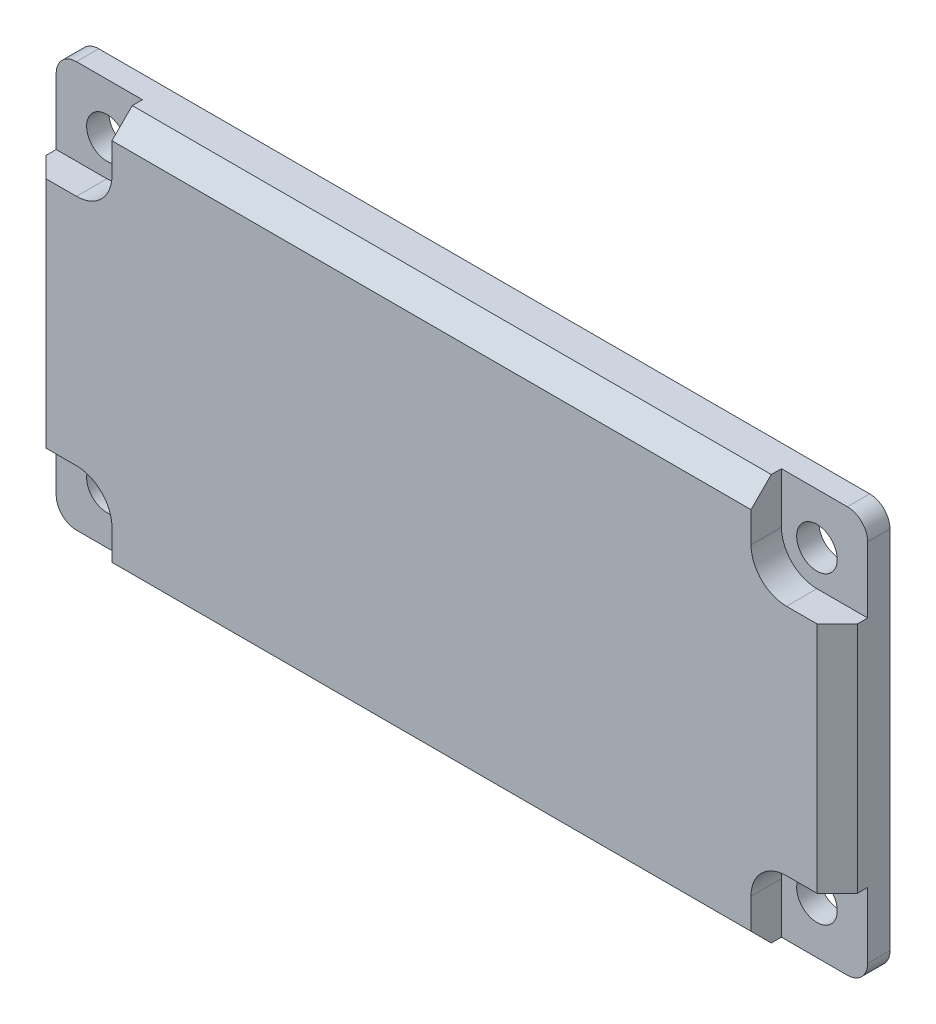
ISO-10303-21;
HEADER;
FILE_DESCRIPTION(('STEP AP214'),'2;1');
FILE_NAME('part.step','',(''),(''),'','','');
FILE_SCHEMA(('AUTOMOTIVE_DESIGN { 1 0 10303 214 1 1 1 1 }'));
ENDSEC;
DATA;
#1=APPLICATION_CONTEXT('core data for automotive mechanical design processes');
#2=APPLICATION_PROTOCOL_DEFINITION('international standard','automotive_design',2000,#1);
#3=PRODUCT_CONTEXT('',#1,'mechanical');
#4=PRODUCT('Part','Part','',(#3));
#5=PRODUCT_RELATED_PRODUCT_CATEGORY('part','',(#4));
#6=PRODUCT_DEFINITION_FORMATION('','',#4);
#7=PRODUCT_DEFINITION_CONTEXT('part definition',#1,'design');
#8=PRODUCT_DEFINITION('design','',#6,#7);
#9=PRODUCT_DEFINITION_SHAPE('','',#8);
#10=(LENGTH_UNIT() NAMED_UNIT(*) SI_UNIT(.MILLI.,.METRE.));
#11=(NAMED_UNIT(*) PLANE_ANGLE_UNIT() SI_UNIT($,.RADIAN.));
#12=(NAMED_UNIT(*) SI_UNIT($,.STERADIAN.) SOLID_ANGLE_UNIT());
#13=UNCERTAINTY_MEASURE_WITH_UNIT(LENGTH_MEASURE(1.E-05),#10,'distance_accuracy_value','');
#14=(GEOMETRIC_REPRESENTATION_CONTEXT(3) GLOBAL_UNCERTAINTY_ASSIGNED_CONTEXT((#13)) GLOBAL_UNIT_ASSIGNED_CONTEXT((#10,
#11,#12)) REPRESENTATION_CONTEXT('',''));
#15=CARTESIAN_POINT('',(0.,0.,0.));
#16=DIRECTION('',(0.,0.,1.));
#17=DIRECTION('',(1.,0.,0.));
#18=AXIS2_PLACEMENT_3D('',#15,#16,#17);
#19=CARTESIAN_POINT('',(-19.,9.,2.6));
#20=DIRECTION('',(0.,0.,-1.));
#21=DIRECTION('',(-1.,0.,0.));
#22=AXIS2_PLACEMENT_3D('',#19,#20,#21);
#23=CYLINDRICAL_SURFACE('',#22,0.999999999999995);
#24=CARTESIAN_POINT('',(-19.,9.,1.1));
#25=DIRECTION('',(0.,0.,1.));
#26=DIRECTION('',(1.,0.,0.));
#27=AXIS2_PLACEMENT_3D('',#24,#25,#26);
#28=CIRCLE('',#27,0.999999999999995);
#29=CARTESIAN_POINT('',(-19.,9.99999999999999,1.1));
#30=VERTEX_POINT('',#29);
#31=CARTESIAN_POINT('',(-20.,9.00000000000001,1.1));
#32=VERTEX_POINT('',#31);
#33=EDGE_CURVE('E322',#30,#32,#28,.T.);
#34=ORIENTED_EDGE('',*,*,#33,.F.);
#35=DIRECTION('',(0.,0.,-1.));
#36=VECTOR('',#35,1.);
#37=CARTESIAN_POINT('',(-19.,9.99999999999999,2.6));
#38=LINE('',#37,#36);
#39=CARTESIAN_POINT('',(-19.,9.99999999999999,0.));
#40=VERTEX_POINT('',#39);
#41=EDGE_CURVE('E391',#30,#40,#38,.T.);
#42=ORIENTED_EDGE('',*,*,#41,.T.);
#43=CARTESIAN_POINT('',(-19.,9.,0.));
#44=DIRECTION('',(0.,0.,1.));
#45=DIRECTION('',(1.,0.,0.));
#46=AXIS2_PLACEMENT_3D('',#43,#44,#45);
#47=CIRCLE('',#46,0.999999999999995);
#48=CARTESIAN_POINT('',(-20.,9.00000000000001,0.));
#49=VERTEX_POINT('',#48);
#50=EDGE_CURVE('E367',#40,#49,#47,.T.);
#51=ORIENTED_EDGE('',*,*,#50,.T.);
#52=DIRECTION('',(0.,0.,-1.));
#53=VECTOR('',#52,1.);
#54=CARTESIAN_POINT('',(-20.,9.00000000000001,2.6));
#55=LINE('',#54,#53);
#56=EDGE_CURVE('E405',#32,#49,#55,.T.);
#57=ORIENTED_EDGE('',*,*,#56,.F.);
#58=EDGE_LOOP('',(#34,#42,#51,#57));
#59=FACE_BOUND('',#58,.T.);
#60=ADVANCED_FACE('F33',(#59),#23,.T.);
#61=CARTESIAN_POINT('',(-20.,-9.00000000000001,2.6));
#62=DIRECTION('',(1.,0.,0.));
#63=DIRECTION('',(0.,1.,0.));
#64=AXIS2_PLACEMENT_3D('',#61,#62,#63);
#65=PLANE('',#64);
#66=DIRECTION('',(0.,-1.,0.));
#67=VECTOR('',#66,1.);
#68=CARTESIAN_POINT('',(-20.,-9.00000000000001,1.1));
#69=LINE('',#68,#67);
#70=CARTESIAN_POINT('',(-20.,5.75000000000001,1.1));
#71=VERTEX_POINT('',#70);
#72=EDGE_CURVE('E325',#32,#71,#69,.T.);
#73=ORIENTED_EDGE('',*,*,#72,.F.);
#74=ORIENTED_EDGE('',*,*,#56,.T.);
#75=DIRECTION('',(0.,-1.,0.));
#76=VECTOR('',#75,1.);
#77=CARTESIAN_POINT('',(-20.,-9.00000000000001,0.));
#78=LINE('',#77,#76);
#79=CARTESIAN_POINT('',(-20.,-9.00000000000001,0.));
#80=VERTEX_POINT('',#79);
#81=EDGE_CURVE('E370',#49,#80,#78,.T.);
#82=ORIENTED_EDGE('',*,*,#81,.T.);
#83=DIRECTION('',(0.,0.,-1.));
#84=VECTOR('',#83,1.);
#85=CARTESIAN_POINT('',(-20.,-9.00000000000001,2.6));
#86=LINE('',#85,#84);
#87=CARTESIAN_POINT('',(-20.,-9.00000000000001,1.1));
#88=VERTEX_POINT('',#87);
#89=EDGE_CURVE('E403',#88,#80,#86,.T.);
#90=ORIENTED_EDGE('',*,*,#89,.F.);
#91=CARTESIAN_POINT('',(-20.,-5.75000000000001,1.1));
#92=VERTEX_POINT('',#91);
#93=EDGE_CURVE('E327',#92,#88,#69,.T.);
#94=ORIENTED_EDGE('',*,*,#93,.F.);
#95=DIRECTION('',(0.,0.,-1.));
#96=VECTOR('',#95,1.);
#97=CARTESIAN_POINT('',(-20.,-5.75000000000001,2.6));
#98=LINE('',#97,#96);
#99=CARTESIAN_POINT('',(-20.,-5.75000000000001,1.6));
#100=VERTEX_POINT('',#99);
#101=EDGE_CURVE('E344',#100,#92,#98,.T.);
#102=ORIENTED_EDGE('',*,*,#101,.F.);
#103=DIRECTION('',(0.,1.,0.));
#104=VECTOR('',#103,1.);
#105=CARTESIAN_POINT('',(-20.,9.00000000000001,1.6));
#106=LINE('',#105,#104);
#107=CARTESIAN_POINT('',(-20.,5.75000000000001,1.6));
#108=VERTEX_POINT('',#107);
#109=EDGE_CURVE('E420',#100,#108,#106,.T.);
#110=ORIENTED_EDGE('',*,*,#109,.T.);
#111=DIRECTION('',(0.,0.,1.));
#112=VECTOR('',#111,1.);
#113=CARTESIAN_POINT('',(-20.,5.75000000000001,2.6));
#114=LINE('',#113,#112);
#115=EDGE_CURVE('E346',#71,#108,#114,.T.);
#116=ORIENTED_EDGE('',*,*,#115,.F.);
#117=EDGE_LOOP('',(#73,#74,#82,#90,#94,#102,#110,#116));
#118=FACE_BOUND('',#117,.T.);
#119=ADVANCED_FACE('F535',(#118),#65,.F.);
#120=CARTESIAN_POINT('',(-19.,-9.,2.6));
#121=DIRECTION('',(0.,0.,-1.));
#122=DIRECTION('',(-1.,0.,0.));
#123=AXIS2_PLACEMENT_3D('',#120,#121,#122);
#124=CYLINDRICAL_SURFACE('',#123,0.999999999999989);
#125=CARTESIAN_POINT('',(-19.,-9.,1.1));
#126=DIRECTION('',(0.,0.,1.));
#127=DIRECTION('',(1.,0.,0.));
#128=AXIS2_PLACEMENT_3D('',#125,#126,#127);
#129=CIRCLE('',#128,0.999999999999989);
#130=CARTESIAN_POINT('',(-19.,-9.99999999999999,1.1));
#131=VERTEX_POINT('',#130);
#132=EDGE_CURVE('E338',#88,#131,#129,.T.);
#133=ORIENTED_EDGE('',*,*,#132,.F.);
#134=ORIENTED_EDGE('',*,*,#89,.T.);
#135=CARTESIAN_POINT('',(-19.,-9.,0.));
#136=DIRECTION('',(0.,0.,1.));
#137=DIRECTION('',(1.,0.,0.));
#138=AXIS2_PLACEMENT_3D('',#135,#136,#137);
#139=CIRCLE('',#138,0.999999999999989);
#140=CARTESIAN_POINT('',(-19.,-9.99999999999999,0.));
#141=VERTEX_POINT('',#140);
#142=EDGE_CURVE('E373',#80,#141,#139,.T.);
#143=ORIENTED_EDGE('',*,*,#142,.T.);
#144=DIRECTION('',(0.,0.,-1.));
#145=VECTOR('',#144,1.);
#146=CARTESIAN_POINT('',(-19.,-9.99999999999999,2.6));
#147=LINE('',#146,#145);
#148=EDGE_CURVE('E401',#131,#141,#147,.T.);
#149=ORIENTED_EDGE('',*,*,#148,.F.);
#150=EDGE_LOOP('',(#133,#134,#143,#149));
#151=FACE_BOUND('',#150,.T.);
#152=ADVANCED_FACE('F479',(#151),#124,.T.);
#153=CARTESIAN_POINT('',(19.,-9.99999999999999,2.6));
#154=DIRECTION('',(0.,1.,0.));
#155=DIRECTION('',(-1.,0.,0.));
#156=AXIS2_PLACEMENT_3D('',#153,#154,#155);
#157=PLANE('',#156);
#158=DIRECTION('',(1.,0.,0.));
#159=VECTOR('',#158,1.);
#160=CARTESIAN_POINT('',(19.,-9.99999999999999,1.1));
#161=LINE('',#160,#159);
#162=CARTESIAN_POINT('',(15.75,-9.99999999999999,1.1));
#163=VERTEX_POINT('',#162);
#164=CARTESIAN_POINT('',(19.,-9.99999999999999,1.1));
#165=VERTEX_POINT('',#164);
#166=EDGE_CURVE('E335',#163,#165,#161,.T.);
#167=ORIENTED_EDGE('',*,*,#166,.F.);
#168=DIRECTION('',(0.,0.,-1.));
#169=VECTOR('',#168,1.);
#170=CARTESIAN_POINT('',(15.75,-9.99999999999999,2.6));
#171=LINE('',#170,#169);
#172=CARTESIAN_POINT('',(15.75,-9.99999999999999,1.6));
#173=VERTEX_POINT('',#172);
#174=EDGE_CURVE('E353',#173,#163,#171,.T.);
#175=ORIENTED_EDGE('',*,*,#174,.F.);
#176=DIRECTION('',(-1.,0.,0.));
#177=VECTOR('',#176,1.);
#178=CARTESIAN_POINT('',(-19.,-9.99999999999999,1.6));
#179=LINE('',#178,#177);
#180=CARTESIAN_POINT('',(-15.75,-9.99999999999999,1.6));
#181=VERTEX_POINT('',#180);
#182=EDGE_CURVE('E426',#173,#181,#179,.T.);
#183=ORIENTED_EDGE('',*,*,#182,.T.);
#184=DIRECTION('',(0.,0.,1.));
#185=VECTOR('',#184,1.);
#186=CARTESIAN_POINT('',(-15.75,-9.99999999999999,2.6));
#187=LINE('',#186,#185);
#188=CARTESIAN_POINT('',(-15.75,-9.99999999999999,1.1));
#189=VERTEX_POINT('',#188);
#190=EDGE_CURVE('E351',#189,#181,#187,.T.);
#191=ORIENTED_EDGE('',*,*,#190,.F.);
#192=EDGE_CURVE('E337',#131,#189,#161,.T.);
#193=ORIENTED_EDGE('',*,*,#192,.F.);
#194=ORIENTED_EDGE('',*,*,#148,.T.);
#195=DIRECTION('',(1.,0.,0.));
#196=VECTOR('',#195,1.);
#197=CARTESIAN_POINT('',(19.,-9.99999999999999,0.));
#198=LINE('',#197,#196);
#199=CARTESIAN_POINT('',(19.,-9.99999999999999,0.));
#200=VERTEX_POINT('',#199);
#201=EDGE_CURVE('E376',#141,#200,#198,.T.);
#202=ORIENTED_EDGE('',*,*,#201,.T.);
#203=DIRECTION('',(0.,0.,-1.));
#204=VECTOR('',#203,1.);
#205=CARTESIAN_POINT('',(19.,-9.99999999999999,2.6));
#206=LINE('',#205,#204);
#207=EDGE_CURVE('E399',#165,#200,#206,.T.);
#208=ORIENTED_EDGE('',*,*,#207,.F.);
#209=EDGE_LOOP('',(#167,#175,#183,#191,#193,#194,#202,#208));
#210=FACE_BOUND('',#209,.T.);
#211=ADVANCED_FACE('F456',(#210),#157,.F.);
#212=CARTESIAN_POINT('',(19.,-8.99999999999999,2.6));
#213=DIRECTION('',(0.,0.,-1.));
#214=DIRECTION('',(-1.,0.,0.));
#215=AXIS2_PLACEMENT_3D('',#212,#213,#214);
#216=CYLINDRICAL_SURFACE('',#215,0.999999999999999);
#217=CARTESIAN_POINT('',(19.,-8.99999999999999,1.1));
#218=DIRECTION('',(0.,0.,1.));
#219=DIRECTION('',(1.,0.,0.));
#220=AXIS2_PLACEMENT_3D('',#217,#218,#219);
#221=CIRCLE('',#220,0.999999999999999);
#222=CARTESIAN_POINT('',(20.,-9.,1.1));
#223=VERTEX_POINT('',#222);
#224=EDGE_CURVE('E333',#165,#223,#221,.T.);
#225=ORIENTED_EDGE('',*,*,#224,.F.);
#226=ORIENTED_EDGE('',*,*,#207,.T.);
#227=CARTESIAN_POINT('',(19.,-8.99999999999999,0.));
#228=DIRECTION('',(0.,0.,1.));
#229=DIRECTION('',(1.,0.,0.));
#230=AXIS2_PLACEMENT_3D('',#227,#228,#229);
#231=CIRCLE('',#230,0.999999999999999);
#232=CARTESIAN_POINT('',(20.,-9.,0.));
#233=VERTEX_POINT('',#232);
#234=EDGE_CURVE('E379',#200,#233,#231,.T.);
#235=ORIENTED_EDGE('',*,*,#234,.T.);
#236=DIRECTION('',(0.,0.,-1.));
#237=VECTOR('',#236,1.);
#238=CARTESIAN_POINT('',(20.,-9.,2.6));
#239=LINE('',#238,#237);
#240=EDGE_CURVE('E397',#223,#233,#239,.T.);
#241=ORIENTED_EDGE('',*,*,#240,.F.);
#242=EDGE_LOOP('',(#225,#226,#235,#241));
#243=FACE_BOUND('',#242,.T.);
#244=ADVANCED_FACE('F490',(#243),#216,.T.);
#245=CARTESIAN_POINT('',(20.,9.,2.6));
#246=DIRECTION('',(-1.,0.,0.));
#247=DIRECTION('',(0.,0.,1.));
#248=AXIS2_PLACEMENT_3D('',#245,#246,#247);
#249=PLANE('',#248);
#250=DIRECTION('',(0.,1.,0.));
#251=VECTOR('',#250,1.);
#252=CARTESIAN_POINT('',(20.,9.,1.1));
#253=LINE('',#252,#251);
#254=CARTESIAN_POINT('',(20.,5.75000000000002,1.1));
#255=VERTEX_POINT('',#254);
#256=CARTESIAN_POINT('',(20.,8.99999999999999,1.1));
#257=VERTEX_POINT('',#256);
#258=EDGE_CURVE('E330',#255,#257,#253,.T.);
#259=ORIENTED_EDGE('',*,*,#258,.F.);
#260=DIRECTION('',(0.,0.,-1.));
#261=VECTOR('',#260,1.);
#262=CARTESIAN_POINT('',(20.,5.75000000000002,2.6));
#263=LINE('',#262,#261);
#264=CARTESIAN_POINT('',(20.,5.75000000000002,1.6));
#265=VERTEX_POINT('',#264);
#266=EDGE_CURVE('E349',#265,#255,#263,.T.);
#267=ORIENTED_EDGE('',*,*,#266,.F.);
#268=DIRECTION('',(0.,-1.,0.));
#269=VECTOR('',#268,1.);
#270=CARTESIAN_POINT('',(20.,-9.,1.6));
#271=LINE('',#270,#269);
#272=CARTESIAN_POINT('',(20.,-5.75,1.6));
#273=VERTEX_POINT('',#272);
#274=EDGE_CURVE('E423',#265,#273,#271,.T.);
#275=ORIENTED_EDGE('',*,*,#274,.T.);
#276=DIRECTION('',(0.,0.,1.));
#277=VECTOR('',#276,1.);
#278=CARTESIAN_POINT('',(20.,-5.75,2.6));
#279=LINE('',#278,#277);
#280=CARTESIAN_POINT('',(20.,-5.75000000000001,1.1));
#281=VERTEX_POINT('',#280);
#282=EDGE_CURVE('E47',#281,#273,#279,.T.);
#283=ORIENTED_EDGE('',*,*,#282,.F.);
#284=EDGE_CURVE('E332',#223,#281,#253,.T.);
#285=ORIENTED_EDGE('',*,*,#284,.F.);
#286=ORIENTED_EDGE('',*,*,#240,.T.);
#287=DIRECTION('',(0.,1.,0.));
#288=VECTOR('',#287,1.);
#289=CARTESIAN_POINT('',(20.,9.,0.));
#290=LINE('',#289,#288);
#291=CARTESIAN_POINT('',(20.,9.,0.));
#292=VERTEX_POINT('',#291);
#293=EDGE_CURVE('E382',#233,#292,#290,.T.);
#294=ORIENTED_EDGE('',*,*,#293,.T.);
#295=DIRECTION('',(0.,0.,-1.));
#296=VECTOR('',#295,1.);
#297=CARTESIAN_POINT('',(20.,9.,2.6));
#298=LINE('',#297,#296);
#299=EDGE_CURVE('E395',#257,#292,#298,.T.);
#300=ORIENTED_EDGE('',*,*,#299,.F.);
#301=EDGE_LOOP('',(#259,#267,#275,#283,#285,#286,#294,#300));
#302=FACE_BOUND('',#301,.T.);
#303=ADVANCED_FACE('F495',(#302),#249,.F.);
#304=CARTESIAN_POINT('',(19.,8.99999999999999,2.6));
#305=DIRECTION('',(0.,0.,-1.));
#306=DIRECTION('',(-1.,0.,0.));
#307=AXIS2_PLACEMENT_3D('',#304,#305,#306);
#308=CYLINDRICAL_SURFACE('',#307,0.999999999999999);
#309=CARTESIAN_POINT('',(19.,8.99999999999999,1.1));
#310=DIRECTION('',(0.,0.,1.));
#311=DIRECTION('',(1.,0.,0.));
#312=AXIS2_PLACEMENT_3D('',#309,#310,#311);
#313=CIRCLE('',#312,0.999999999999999);
#314=CARTESIAN_POINT('',(19.,9.99999999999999,1.1));
#315=VERTEX_POINT('',#314);
#316=EDGE_CURVE('E328',#257,#315,#313,.T.);
#317=ORIENTED_EDGE('',*,*,#316,.F.);
#318=ORIENTED_EDGE('',*,*,#299,.T.);
#319=CARTESIAN_POINT('',(19.,8.99999999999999,0.));
#320=DIRECTION('',(0.,0.,1.));
#321=DIRECTION('',(1.,0.,0.));
#322=AXIS2_PLACEMENT_3D('',#319,#320,#321);
#323=CIRCLE('',#322,0.999999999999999);
#324=CARTESIAN_POINT('',(19.,9.99999999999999,0.));
#325=VERTEX_POINT('',#324);
#326=EDGE_CURVE('E385',#292,#325,#323,.T.);
#327=ORIENTED_EDGE('',*,*,#326,.T.);
#328=DIRECTION('',(0.,0.,-1.));
#329=VECTOR('',#328,1.);
#330=CARTESIAN_POINT('',(19.,9.99999999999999,2.6));
#331=LINE('',#330,#329);
#332=EDGE_CURVE('E393',#315,#325,#331,.T.);
#333=ORIENTED_EDGE('',*,*,#332,.F.);
#334=EDGE_LOOP('',(#317,#318,#327,#333));
#335=FACE_BOUND('',#334,.T.);
#336=ADVANCED_FACE('F543',(#335),#308,.T.);
#337=CARTESIAN_POINT('',(-19.,9.99999999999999,2.6));
#338=DIRECTION('',(0.,-1.,0.));
#339=DIRECTION('',(1.,0.,0.));
#340=AXIS2_PLACEMENT_3D('',#337,#338,#339);
#341=PLANE('',#340);
#342=DIRECTION('',(-1.,0.,0.));
#343=VECTOR('',#342,1.);
#344=CARTESIAN_POINT('',(-19.,9.99999999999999,1.1));
#345=LINE('',#344,#343);
#346=CARTESIAN_POINT('',(-15.75,9.99999999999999,1.1));
#347=VERTEX_POINT('',#346);
#348=EDGE_CURVE('E320',#347,#30,#345,.T.);
#349=ORIENTED_EDGE('',*,*,#348,.F.);
#350=DIRECTION('',(0.,0.,-1.));
#351=VECTOR('',#350,1.);
#352=CARTESIAN_POINT('',(-15.75,9.99999999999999,2.6));
#353=LINE('',#352,#351);
#354=CARTESIAN_POINT('',(-15.75,9.99999999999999,1.6));
#355=VERTEX_POINT('',#354);
#356=EDGE_CURVE('E342',#355,#347,#353,.T.);
#357=ORIENTED_EDGE('',*,*,#356,.F.);
#358=DIRECTION('',(1.,0.,0.));
#359=VECTOR('',#358,1.);
#360=CARTESIAN_POINT('',(19.,9.99999999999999,1.6));
#361=LINE('',#360,#359);
#362=CARTESIAN_POINT('',(15.75,9.99999999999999,1.6));
#363=VERTEX_POINT('',#362);
#364=EDGE_CURVE('E417',#355,#363,#361,.T.);
#365=ORIENTED_EDGE('',*,*,#364,.T.);
#366=DIRECTION('',(0.,0.,1.));
#367=VECTOR('',#366,1.);
#368=CARTESIAN_POINT('',(15.75,9.99999999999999,2.6));
#369=LINE('',#368,#367);
#370=CARTESIAN_POINT('',(15.75,9.99999999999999,1.1));
#371=VERTEX_POINT('',#370);
#372=EDGE_CURVE('E340',#371,#363,#369,.T.);
#373=ORIENTED_EDGE('',*,*,#372,.F.);
#374=EDGE_CURVE('E323',#315,#371,#345,.T.);
#375=ORIENTED_EDGE('',*,*,#374,.F.);
#376=ORIENTED_EDGE('',*,*,#332,.T.);
#377=DIRECTION('',(-1.,0.,0.));
#378=VECTOR('',#377,1.);
#379=CARTESIAN_POINT('',(-19.,9.99999999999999,0.));
#380=LINE('',#379,#378);
#381=EDGE_CURVE('E388',#325,#40,#380,.T.);
#382=ORIENTED_EDGE('',*,*,#381,.T.);
#383=ORIENTED_EDGE('',*,*,#41,.F.);
#384=EDGE_LOOP('',(#349,#357,#365,#373,#375,#376,#382,#383));
#385=FACE_BOUND('',#384,.T.);
#386=ADVANCED_FACE('F524',(#385),#341,.F.);
#387=CARTESIAN_POINT('',(-19.,9.,2.6));
#388=DIRECTION('',(0.,0.,1.));
#389=DIRECTION('',(1.,0.,0.));
#390=AXIS2_PLACEMENT_3D('',#387,#388,#389);
#391=PLANE('',#390);
#392=CARTESIAN_POINT('',(-17.5,7.49999999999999,2.6));
#393=DIRECTION('',(0.,0.,-1.));
#394=DIRECTION('',(1.,0.,0.));
#395=AXIS2_PLACEMENT_3D('',#392,#393,#394);
#396=CIRCLE('',#395,1.74999999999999);
#397=CARTESIAN_POINT('',(-15.75,7.50000000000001,2.6));
#398=VERTEX_POINT('',#397);
#399=CARTESIAN_POINT('',(-17.5,5.75000000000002,2.6));
#400=VERTEX_POINT('',#399);
#401=EDGE_CURVE('E265',#398,#400,#396,.T.);
#402=ORIENTED_EDGE('',*,*,#401,.T.);
#403=DIRECTION('',(-1.,0.,0.));
#404=VECTOR('',#403,1.);
#405=CARTESIAN_POINT('',(-22.2797960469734,5.75,2.6));
#406=LINE('',#405,#404);
#407=CARTESIAN_POINT('',(-19.,5.75000000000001,2.6));
#408=VERTEX_POINT('',#407);
#409=EDGE_CURVE('E267',#400,#408,#406,.T.);
#410=ORIENTED_EDGE('',*,*,#409,.T.);
#411=DIRECTION('',(0.,-1.,0.));
#412=VECTOR('',#411,1.);
#413=CARTESIAN_POINT('',(-19.,-9.00000000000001,2.6));
#414=LINE('',#413,#412);
#415=CARTESIAN_POINT('',(-19.,-5.75000000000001,2.6));
#416=VERTEX_POINT('',#415);
#417=EDGE_CURVE('E240',#408,#416,#414,.T.);
#418=ORIENTED_EDGE('',*,*,#417,.T.);
#419=DIRECTION('',(1.,0.,0.));
#420=VECTOR('',#419,1.);
#421=CARTESIAN_POINT('',(-22.2797960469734,-5.75000000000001,2.6));
#422=LINE('',#421,#420);
#423=CARTESIAN_POINT('',(-17.5,-5.75000000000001,2.6));
#424=VERTEX_POINT('',#423);
#425=EDGE_CURVE('E55',#416,#424,#422,.T.);
#426=ORIENTED_EDGE('',*,*,#425,.T.);
#427=CARTESIAN_POINT('',(-17.5,-7.5,2.6));
#428=DIRECTION('',(0.,0.,-1.));
#429=DIRECTION('',(-1.,0.,0.));
#430=AXIS2_PLACEMENT_3D('',#427,#428,#429);
#431=CIRCLE('',#430,1.74999999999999);
#432=CARTESIAN_POINT('',(-15.75,-7.5,2.6));
#433=VERTEX_POINT('',#432);
#434=EDGE_CURVE('E228',#424,#433,#431,.T.);
#435=ORIENTED_EDGE('',*,*,#434,.T.);
#436=DIRECTION('',(0.,-1.,0.));
#437=VECTOR('',#436,1.);
#438=CARTESIAN_POINT('',(-15.75,-7.5,2.6));
#439=LINE('',#438,#437);
#440=CARTESIAN_POINT('',(-15.75,-8.99999999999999,2.6));
#441=VERTEX_POINT('',#440);
#442=EDGE_CURVE('E233',#433,#441,#439,.T.);
#443=ORIENTED_EDGE('',*,*,#442,.T.);
#444=DIRECTION('',(1.,0.,0.));
#445=VECTOR('',#444,1.);
#446=CARTESIAN_POINT('',(19.,-8.99999999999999,2.6));
#447=LINE('',#446,#445);
#448=CARTESIAN_POINT('',(15.75,-8.99999999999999,2.6));
#449=VERTEX_POINT('',#448);
#450=EDGE_CURVE('E407',#441,#449,#447,.T.);
#451=ORIENTED_EDGE('',*,*,#450,.T.);
#452=DIRECTION('',(0.,1.,0.));
#453=VECTOR('',#452,1.);
#454=CARTESIAN_POINT('',(15.75,-11.9304852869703,2.6));
#455=LINE('',#454,#453);
#456=CARTESIAN_POINT('',(15.75,-7.5,2.6));
#457=VERTEX_POINT('',#456);
#458=EDGE_CURVE('E244',#449,#457,#455,.T.);
#459=ORIENTED_EDGE('',*,*,#458,.T.);
#460=CARTESIAN_POINT('',(17.5,-7.49999999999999,2.6));
#461=DIRECTION('',(0.,0.,-1.));
#462=DIRECTION('',(-1.,0.,0.));
#463=AXIS2_PLACEMENT_3D('',#460,#461,#462);
#464=CIRCLE('',#463,1.74999999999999);
#465=CARTESIAN_POINT('',(17.5,-5.75000000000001,2.6));
#466=VERTEX_POINT('',#465);
#467=EDGE_CURVE('E247',#457,#466,#464,.T.);
#468=ORIENTED_EDGE('',*,*,#467,.T.);
#469=DIRECTION('',(1.,0.,0.));
#470=VECTOR('',#469,1.);
#471=CARTESIAN_POINT('',(17.5,-5.75000000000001,2.6));
#472=LINE('',#471,#470);
#473=CARTESIAN_POINT('',(19.,-5.75000000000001,2.6));
#474=VERTEX_POINT('',#473);
#475=EDGE_CURVE('E250',#466,#474,#472,.T.);
#476=ORIENTED_EDGE('',*,*,#475,.T.);
#477=DIRECTION('',(0.,1.,0.));
#478=VECTOR('',#477,1.);
#479=CARTESIAN_POINT('',(19.,9.,2.6));
#480=LINE('',#479,#478);
#481=CARTESIAN_POINT('',(19.,5.75000000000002,2.6));
#482=VERTEX_POINT('',#481);
#483=EDGE_CURVE('E410',#474,#482,#480,.T.);
#484=ORIENTED_EDGE('',*,*,#483,.T.);
#485=DIRECTION('',(-1.,0.,0.));
#486=VECTOR('',#485,1.);
#487=CARTESIAN_POINT('',(17.5,5.75000000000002,2.6));
#488=LINE('',#487,#486);
#489=CARTESIAN_POINT('',(17.5,5.75000000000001,2.6));
#490=VERTEX_POINT('',#489);
#491=EDGE_CURVE('E253',#482,#490,#488,.T.);
#492=ORIENTED_EDGE('',*,*,#491,.T.);
#493=CARTESIAN_POINT('',(17.5,7.5,2.6));
#494=DIRECTION('',(0.,0.,-1.));
#495=DIRECTION('',(1.,0.,0.));
#496=AXIS2_PLACEMENT_3D('',#493,#494,#495);
#497=CIRCLE('',#496,1.74999999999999);
#498=CARTESIAN_POINT('',(15.75,7.50000000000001,2.6));
#499=VERTEX_POINT('',#498);
#500=EDGE_CURVE('E256',#490,#499,#497,.T.);
#501=ORIENTED_EDGE('',*,*,#500,.T.);
#502=DIRECTION('',(0.,1.,0.));
#503=VECTOR('',#502,1.);
#504=CARTESIAN_POINT('',(15.75,11.9304852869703,2.6));
#505=LINE('',#504,#503);
#506=CARTESIAN_POINT('',(15.75,8.99999999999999,2.6));
#507=VERTEX_POINT('',#506);
#508=EDGE_CURVE('E259',#499,#507,#505,.T.);
#509=ORIENTED_EDGE('',*,*,#508,.T.);
#510=DIRECTION('',(-1.,0.,0.));
#511=VECTOR('',#510,1.);
#512=CARTESIAN_POINT('',(-19.,8.99999999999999,2.6));
#513=LINE('',#512,#511);
#514=CARTESIAN_POINT('',(-15.75,8.99999999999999,2.6));
#515=VERTEX_POINT('',#514);
#516=EDGE_CURVE('E414',#507,#515,#513,.T.);
#517=ORIENTED_EDGE('',*,*,#516,.T.);
#518=DIRECTION('',(0.,-1.,0.));
#519=VECTOR('',#518,1.);
#520=CARTESIAN_POINT('',(-15.75,7.50000000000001,2.6));
#521=LINE('',#520,#519);
#522=EDGE_CURVE('E262',#515,#398,#521,.T.);
#523=ORIENTED_EDGE('',*,*,#522,.T.);
#524=EDGE_LOOP('',(#402,#410,#418,#426,#435,#443,#451,#459,#468,#476,#484,#492,#501,#509,#517,#523));
#525=FACE_BOUND('',#524,.T.);
#526=ADVANCED_FACE('F237',(#525),#391,.T.);
#527=CARTESIAN_POINT('',(-19.,-8.99999999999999,2.6));
#528=DIRECTION('',(0.,-0.707106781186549,0.707106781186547));
#529=DIRECTION('',(0.,-0.707106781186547,-0.707106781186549));
#530=AXIS2_PLACEMENT_3D('',#527,#528,#529);
#531=PLANE('',#530);
#532=ORIENTED_EDGE('',*,*,#182,.F.);
#533=DIRECTION('',(0.,0.707106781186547,0.707106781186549));
#534=VECTOR('',#533,1.);
#535=CARTESIAN_POINT('',(15.75,-8.99999999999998,2.60000000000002));
#536=LINE('',#535,#534);
#537=EDGE_CURVE('E12',#173,#449,#536,.T.);
#538=ORIENTED_EDGE('',*,*,#537,.T.);
#539=ORIENTED_EDGE('',*,*,#450,.F.);
#540=DIRECTION('',(0.,-0.707106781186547,-0.707106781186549));
#541=VECTOR('',#540,1.);
#542=CARTESIAN_POINT('',(-15.75,-8.99999999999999,2.6));
#543=LINE('',#542,#541);
#544=EDGE_CURVE('E40',#441,#181,#543,.T.);
#545=ORIENTED_EDGE('',*,*,#544,.T.);
#546=EDGE_LOOP('',(#532,#538,#539,#545));
#547=FACE_BOUND('',#546,.T.);
#548=ADVANCED_FACE('F450',(#547),#531,.T.);
#549=CARTESIAN_POINT('',(19.,9.,2.6));
#550=DIRECTION('',(0.70710678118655,0.,0.707106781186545));
#551=DIRECTION('',(0.707106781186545,0.,-0.70710678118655));
#552=AXIS2_PLACEMENT_3D('',#549,#550,#551);
#553=PLANE('',#552);
#554=ORIENTED_EDGE('',*,*,#274,.F.);
#555=DIRECTION('',(-0.707106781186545,0.,0.70710678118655));
#556=VECTOR('',#555,1.);
#557=CARTESIAN_POINT('',(19.,5.75000000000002,2.6));
#558=LINE('',#557,#556);
#559=EDGE_CURVE('E444',#265,#482,#558,.T.);
#560=ORIENTED_EDGE('',*,*,#559,.T.);
#561=ORIENTED_EDGE('',*,*,#483,.F.);
#562=DIRECTION('',(0.707106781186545,0.,-0.70710678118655));
#563=VECTOR('',#562,1.);
#564=CARTESIAN_POINT('',(19.,-5.75000000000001,2.59999999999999));
#565=LINE('',#564,#563);
#566=EDGE_CURVE('E442',#474,#273,#565,.T.);
#567=ORIENTED_EDGE('',*,*,#566,.T.);
#568=EDGE_LOOP('',(#554,#560,#561,#567));
#569=FACE_BOUND('',#568,.T.);
#570=ADVANCED_FACE('F499',(#569),#553,.T.);
#571=CARTESIAN_POINT('',(-19.,9.,2.6));
#572=DIRECTION('',(-0.707106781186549,0.,0.707106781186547));
#573=DIRECTION('',(0.707106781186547,0.,0.707106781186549));
#574=AXIS2_PLACEMENT_3D('',#571,#572,#573);
#575=PLANE('',#574);
#576=ORIENTED_EDGE('',*,*,#417,.F.);
#577=DIRECTION('',(-0.707106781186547,0.,-0.707106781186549));
#578=VECTOR('',#577,1.);
#579=CARTESIAN_POINT('',(-19.,5.75000000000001,2.60000000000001));
#580=LINE('',#579,#578);
#581=EDGE_CURVE('E439',#408,#108,#580,.T.);
#582=ORIENTED_EDGE('',*,*,#581,.T.);
#583=ORIENTED_EDGE('',*,*,#109,.F.);
#584=DIRECTION('',(0.707106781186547,0.,0.707106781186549));
#585=VECTOR('',#584,1.);
#586=CARTESIAN_POINT('',(-19.,-5.75000000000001,2.6));
#587=LINE('',#586,#585);
#588=EDGE_CURVE('E437',#100,#416,#587,.T.);
#589=ORIENTED_EDGE('',*,*,#588,.T.);
#590=EDGE_LOOP('',(#576,#582,#583,#589));
#591=FACE_BOUND('',#590,.T.);
#592=ADVANCED_FACE('F592',(#591),#575,.T.);
#593=CARTESIAN_POINT('',(-19.,8.99999999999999,2.6));
#594=DIRECTION('',(0.,0.707106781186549,0.707106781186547));
#595=DIRECTION('',(0.,-0.707106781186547,0.707106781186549));
#596=AXIS2_PLACEMENT_3D('',#593,#594,#595);
#597=PLANE('',#596);
#598=ORIENTED_EDGE('',*,*,#364,.F.);
#599=DIRECTION('',(0.,-0.707106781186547,0.707106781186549));
#600=VECTOR('',#599,1.);
#601=CARTESIAN_POINT('',(-15.75,9.,2.59999999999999));
#602=LINE('',#601,#600);
#603=EDGE_CURVE('E434',#355,#515,#602,.T.);
#604=ORIENTED_EDGE('',*,*,#603,.T.);
#605=ORIENTED_EDGE('',*,*,#516,.F.);
#606=DIRECTION('',(0.,0.707106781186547,-0.707106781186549));
#607=VECTOR('',#606,1.);
#608=CARTESIAN_POINT('',(15.75,8.99999999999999,2.6));
#609=LINE('',#608,#607);
#610=EDGE_CURVE('E429',#507,#363,#609,.T.);
#611=ORIENTED_EDGE('',*,*,#610,.T.);
#612=EDGE_LOOP('',(#598,#604,#605,#611));
#613=FACE_BOUND('',#612,.T.);
#614=ADVANCED_FACE('F517',(#613),#597,.T.);
#615=CARTESIAN_POINT('',(-17.5,7.49999999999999,0.));
#616=DIRECTION('',(0.,0.,1.));
#617=DIRECTION('',(1.,0.,0.));
#618=AXIS2_PLACEMENT_3D('',#615,#616,#617);
#619=CYLINDRICAL_SURFACE('',#618,1.);
#620=CARTESIAN_POINT('',(-17.5,7.49999999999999,0.));
#621=DIRECTION('',(0.,0.,1.));
#622=DIRECTION('',(1.,0.,0.));
#623=AXIS2_PLACEMENT_3D('',#620,#621,#622);
#624=CIRCLE('',#623,1.);
#625=CARTESIAN_POINT('',(-16.5,7.49999999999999,0.));
#626=VERTEX_POINT('',#625);
#627=EDGE_CURVE('E364',#626,#626,#624,.T.);
#628=ORIENTED_EDGE('',*,*,#627,.F.);
#629=EDGE_LOOP('',(#628));
#630=FACE_BOUND('',#629,.T.);
#631=CARTESIAN_POINT('',(-17.5,7.49999999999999,1.1));
#632=DIRECTION('',(0.,0.,1.));
#633=DIRECTION('',(1.,0.,0.));
#634=AXIS2_PLACEMENT_3D('',#631,#632,#633);
#635=CIRCLE('',#634,1.);
#636=CARTESIAN_POINT('',(-16.5,7.49999999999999,1.1));
#637=VERTEX_POINT('',#636);
#638=EDGE_CURVE('E317',#637,#637,#635,.F.);
#639=ORIENTED_EDGE('',*,*,#638,.F.);
#640=EDGE_LOOP('',(#639));
#641=FACE_BOUND('',#640,.T.);
#642=ADVANCED_FACE('F598',(#630,#641),#619,.F.);
#643=CARTESIAN_POINT('',(17.5,7.49999999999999,0.));
#644=DIRECTION('',(0.,0.,1.));
#645=DIRECTION('',(1.,0.,0.));
#646=AXIS2_PLACEMENT_3D('',#643,#644,#645);
#647=CYLINDRICAL_SURFACE('',#646,1.);
#648=CARTESIAN_POINT('',(17.5,7.49999999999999,0.));
#649=DIRECTION('',(0.,0.,1.));
#650=DIRECTION('',(1.,0.,0.));
#651=AXIS2_PLACEMENT_3D('',#648,#649,#650);
#652=CIRCLE('',#651,1.);
#653=CARTESIAN_POINT('',(18.5,7.49999999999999,0.));
#654=VERTEX_POINT('',#653);
#655=EDGE_CURVE('E361',#654,#654,#652,.T.);
#656=ORIENTED_EDGE('',*,*,#655,.F.);
#657=EDGE_LOOP('',(#656));
#658=FACE_BOUND('',#657,.T.);
#659=CARTESIAN_POINT('',(17.5,7.49999999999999,1.1));
#660=DIRECTION('',(0.,0.,1.));
#661=DIRECTION('',(1.,0.,0.));
#662=AXIS2_PLACEMENT_3D('',#659,#660,#661);
#663=CIRCLE('',#662,1.);
#664=CARTESIAN_POINT('',(18.5,7.49999999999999,1.1));
#665=VERTEX_POINT('',#664);
#666=EDGE_CURVE('E314',#665,#665,#663,.F.);
#667=ORIENTED_EDGE('',*,*,#666,.F.);
#668=EDGE_LOOP('',(#667));
#669=FACE_BOUND('',#668,.T.);
#670=ADVANCED_FACE('F601',(#658,#669),#647,.F.);
#671=CARTESIAN_POINT('',(17.5,-7.49999999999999,0.));
#672=DIRECTION('',(0.,0.,1.));
#673=DIRECTION('',(1.,0.,0.));
#674=AXIS2_PLACEMENT_3D('',#671,#672,#673);
#675=CYLINDRICAL_SURFACE('',#674,1.);
#676=CARTESIAN_POINT('',(17.5,-7.49999999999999,0.));
#677=DIRECTION('',(0.,0.,1.));
#678=DIRECTION('',(1.,0.,0.));
#679=AXIS2_PLACEMENT_3D('',#676,#677,#678);
#680=CIRCLE('',#679,1.);
#681=CARTESIAN_POINT('',(18.5,-7.49999999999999,0.));
#682=VERTEX_POINT('',#681);
#683=EDGE_CURVE('E358',#682,#682,#680,.T.);
#684=ORIENTED_EDGE('',*,*,#683,.F.);
#685=EDGE_LOOP('',(#684));
#686=FACE_BOUND('',#685,.T.);
#687=CARTESIAN_POINT('',(17.5,-7.49999999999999,1.1));
#688=DIRECTION('',(0.,0.,1.));
#689=DIRECTION('',(1.,0.,0.));
#690=AXIS2_PLACEMENT_3D('',#687,#688,#689);
#691=CIRCLE('',#690,1.);
#692=CARTESIAN_POINT('',(18.5,-7.49999999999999,1.1));
#693=VERTEX_POINT('',#692);
#694=EDGE_CURVE('E311',#693,#693,#691,.F.);
#695=ORIENTED_EDGE('',*,*,#694,.F.);
#696=EDGE_LOOP('',(#695));
#697=FACE_BOUND('',#696,.T.);
#698=ADVANCED_FACE('F605',(#686,#697),#675,.F.);
#699=CARTESIAN_POINT('',(-17.5,-7.49999999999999,0.));
#700=DIRECTION('',(0.,0.,1.));
#701=DIRECTION('',(1.,0.,0.));
#702=AXIS2_PLACEMENT_3D('',#699,#700,#701);
#703=CYLINDRICAL_SURFACE('',#702,1.);
#704=CARTESIAN_POINT('',(-17.5,-7.49999999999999,0.));
#705=DIRECTION('',(0.,0.,1.));
#706=DIRECTION('',(1.,0.,0.));
#707=AXIS2_PLACEMENT_3D('',#704,#705,#706);
#708=CIRCLE('',#707,1.);
#709=CARTESIAN_POINT('',(-16.5,-7.49999999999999,0.));
#710=VERTEX_POINT('',#709);
#711=EDGE_CURVE('E355',#710,#710,#708,.T.);
#712=ORIENTED_EDGE('',*,*,#711,.F.);
#713=EDGE_LOOP('',(#712));
#714=FACE_BOUND('',#713,.T.);
#715=CARTESIAN_POINT('',(-17.5,-7.49999999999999,1.1));
#716=DIRECTION('',(0.,0.,1.));
#717=DIRECTION('',(1.,0.,0.));
#718=AXIS2_PLACEMENT_3D('',#715,#716,#717);
#719=CIRCLE('',#718,1.);
#720=CARTESIAN_POINT('',(-16.5,-7.49999999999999,1.1));
#721=VERTEX_POINT('',#720);
#722=EDGE_CURVE('E299',#721,#721,#719,.F.);
#723=ORIENTED_EDGE('',*,*,#722,.F.);
#724=EDGE_LOOP('',(#723));
#725=FACE_BOUND('',#724,.T.);
#726=ADVANCED_FACE('F586',(#714,#725),#703,.F.);
#727=CARTESIAN_POINT('',(-19.,9.,0.));
#728=DIRECTION('',(0.,0.,1.));
#729=DIRECTION('',(1.,0.,0.));
#730=AXIS2_PLACEMENT_3D('',#727,#728,#729);
#731=PLANE('',#730);
#732=ORIENTED_EDGE('',*,*,#711,.T.);
#733=EDGE_LOOP('',(#732));
#734=FACE_BOUND('',#733,.T.);
#735=ORIENTED_EDGE('',*,*,#683,.T.);
#736=EDGE_LOOP('',(#735));
#737=FACE_BOUND('',#736,.T.);
#738=ORIENTED_EDGE('',*,*,#655,.T.);
#739=EDGE_LOOP('',(#738));
#740=FACE_BOUND('',#739,.T.);
#741=ORIENTED_EDGE('',*,*,#627,.T.);
#742=EDGE_LOOP('',(#741));
#743=FACE_BOUND('',#742,.T.);
#744=ORIENTED_EDGE('',*,*,#50,.F.);
#745=ORIENTED_EDGE('',*,*,#381,.F.);
#746=ORIENTED_EDGE('',*,*,#326,.F.);
#747=ORIENTED_EDGE('',*,*,#293,.F.);
#748=ORIENTED_EDGE('',*,*,#234,.F.);
#749=ORIENTED_EDGE('',*,*,#201,.F.);
#750=ORIENTED_EDGE('',*,*,#142,.F.);
#751=ORIENTED_EDGE('',*,*,#81,.F.);
#752=EDGE_LOOP('',(#744,#745,#746,#747,#748,#749,#750,#751));
#753=FACE_BOUND('',#752,.T.);
#754=ADVANCED_FACE('F487',(#734,#737,#740,#743,#753),#731,.F.);
#755=CARTESIAN_POINT('',(0.609603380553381,0.,1.1));
#756=DIRECTION('',(0.,0.,1.));
#757=DIRECTION('',(1.,0.,0.));
#758=AXIS2_PLACEMENT_3D('',#755,#756,#757);
#759=PLANE('',#758);
#760=ORIENTED_EDGE('',*,*,#722,.T.);
#761=EDGE_LOOP('',(#760));
#762=FACE_BOUND('',#761,.T.);
#763=ORIENTED_EDGE('',*,*,#93,.T.);
#764=ORIENTED_EDGE('',*,*,#132,.T.);
#765=ORIENTED_EDGE('',*,*,#192,.T.);
#766=DIRECTION('',(0.,-1.,0.));
#767=VECTOR('',#766,1.);
#768=CARTESIAN_POINT('',(-15.75,-7.5,1.1));
#769=LINE('',#768,#767);
#770=CARTESIAN_POINT('',(-15.75,-7.5,1.1));
#771=VERTEX_POINT('',#770);
#772=EDGE_CURVE('E272',#771,#189,#769,.T.);
#773=ORIENTED_EDGE('',*,*,#772,.F.);
#774=CARTESIAN_POINT('',(-17.5,-7.5,1.1));
#775=DIRECTION('',(0.,0.,-1.));
#776=DIRECTION('',(-1.,0.,0.));
#777=AXIS2_PLACEMENT_3D('',#774,#775,#776);
#778=CIRCLE('',#777,1.74999999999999);
#779=CARTESIAN_POINT('',(-17.5,-5.75000000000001,1.1));
#780=VERTEX_POINT('',#779);
#781=EDGE_CURVE('E270',#780,#771,#778,.T.);
#782=ORIENTED_EDGE('',*,*,#781,.F.);
#783=DIRECTION('',(1.,0.,0.));
#784=VECTOR('',#783,1.);
#785=CARTESIAN_POINT('',(-22.2797960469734,-5.75000000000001,1.1));
#786=LINE('',#785,#784);
#787=EDGE_CURVE('E220',#92,#780,#786,.T.);
#788=ORIENTED_EDGE('',*,*,#787,.F.);
#789=EDGE_LOOP('',(#763,#764,#765,#773,#782,#788));
#790=FACE_BOUND('',#789,.T.);
#791=ADVANCED_FACE('F475',(#762,#790),#759,.T.);
#792=CARTESIAN_POINT('',(-22.2797960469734,-5.75000000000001,1.1));
#793=DIRECTION('',(0.,-1.,0.));
#794=DIRECTION('',(1.,0.,0.));
#795=AXIS2_PLACEMENT_3D('',#792,#793,#794);
#796=PLANE('',#795);
#797=ORIENTED_EDGE('',*,*,#101,.T.);
#798=ORIENTED_EDGE('',*,*,#787,.T.);
#799=DIRECTION('',(0.,0.,1.));
#800=VECTOR('',#799,1.);
#801=CARTESIAN_POINT('',(-17.5,-5.75000000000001,1.1));
#802=LINE('',#801,#800);
#803=EDGE_CURVE('E216',#780,#424,#802,.T.);
#804=ORIENTED_EDGE('',*,*,#803,.T.);
#805=ORIENTED_EDGE('',*,*,#425,.F.);
#806=ORIENTED_EDGE('',*,*,#588,.F.);
#807=EDGE_LOOP('',(#797,#798,#804,#805,#806));
#808=FACE_BOUND('',#807,.T.);
#809=ADVANCED_FACE('F218',(#808),#796,.T.);
#810=CARTESIAN_POINT('',(-15.75,-7.5,1.1));
#811=DIRECTION('',(-1.,0.,0.));
#812=DIRECTION('',(0.,0.,1.));
#813=AXIS2_PLACEMENT_3D('',#810,#811,#812);
#814=PLANE('',#813);
#815=ORIENTED_EDGE('',*,*,#190,.T.);
#816=ORIENTED_EDGE('',*,*,#544,.F.);
#817=ORIENTED_EDGE('',*,*,#442,.F.);
#818=DIRECTION('',(0.,0.,1.));
#819=VECTOR('',#818,1.);
#820=CARTESIAN_POINT('',(-15.75,-7.5,1.1));
#821=LINE('',#820,#819);
#822=EDGE_CURVE('E224',#771,#433,#821,.T.);
#823=ORIENTED_EDGE('',*,*,#822,.F.);
#824=ORIENTED_EDGE('',*,*,#772,.T.);
#825=EDGE_LOOP('',(#815,#816,#817,#823,#824));
#826=FACE_BOUND('',#825,.T.);
#827=ADVANCED_FACE('F472',(#826),#814,.T.);
#828=CARTESIAN_POINT('',(-17.5,-7.5,1.1));
#829=DIRECTION('',(0.,0.,1.));
#830=DIRECTION('',(1.,0.,0.));
#831=AXIS2_PLACEMENT_3D('',#828,#829,#830);
#832=CYLINDRICAL_SURFACE('',#831,1.74999999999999);
#833=ORIENTED_EDGE('',*,*,#434,.F.);
#834=ORIENTED_EDGE('',*,*,#803,.F.);
#835=ORIENTED_EDGE('',*,*,#781,.T.);
#836=ORIENTED_EDGE('',*,*,#822,.T.);
#837=EDGE_LOOP('',(#833,#834,#835,#836));
#838=FACE_BOUND('',#837,.T.);
#839=ADVANCED_FACE('F229',(#838),#832,.F.);
#840=ORIENTED_EDGE('',*,*,#694,.T.);
#841=EDGE_LOOP('',(#840));
#842=FACE_BOUND('',#841,.T.);
#843=ORIENTED_EDGE('',*,*,#166,.T.);
#844=ORIENTED_EDGE('',*,*,#224,.T.);
#845=ORIENTED_EDGE('',*,*,#284,.T.);
#846=DIRECTION('',(1.,0.,0.));
#847=VECTOR('',#846,1.);
#848=CARTESIAN_POINT('',(17.5,-5.75000000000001,1.1));
#849=LINE('',#848,#847);
#850=CARTESIAN_POINT('',(17.5,-5.75000000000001,1.1));
#851=VERTEX_POINT('',#850);
#852=EDGE_CURVE('E280',#851,#281,#849,.T.);
#853=ORIENTED_EDGE('',*,*,#852,.F.);
#854=CARTESIAN_POINT('',(17.5,-7.49999999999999,1.1));
#855=DIRECTION('',(0.,0.,-1.));
#856=DIRECTION('',(-1.,0.,0.));
#857=AXIS2_PLACEMENT_3D('',#854,#855,#856);
#858=CIRCLE('',#857,1.74999999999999);
#859=CARTESIAN_POINT('',(15.75,-7.5,1.1));
#860=VERTEX_POINT('',#859);
#861=EDGE_CURVE('E277',#860,#851,#858,.T.);
#862=ORIENTED_EDGE('',*,*,#861,.F.);
#863=DIRECTION('',(0.,1.,0.));
#864=VECTOR('',#863,1.);
#865=CARTESIAN_POINT('',(15.75,-11.9304852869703,1.1));
#866=LINE('',#865,#864);
#867=EDGE_CURVE('E275',#163,#860,#866,.T.);
#868=ORIENTED_EDGE('',*,*,#867,.F.);
#869=EDGE_LOOP('',(#843,#844,#845,#853,#862,#868));
#870=FACE_BOUND('',#869,.T.);
#871=ADVANCED_FACE('F465',(#842,#870),#759,.T.);
#872=CARTESIAN_POINT('',(17.5,-5.75000000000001,1.1));
#873=DIRECTION('',(0.,-1.,0.));
#874=DIRECTION('',(1.,0.,0.));
#875=AXIS2_PLACEMENT_3D('',#872,#873,#874);
#876=PLANE('',#875);
#877=ORIENTED_EDGE('',*,*,#282,.T.);
#878=ORIENTED_EDGE('',*,*,#566,.F.);
#879=ORIENTED_EDGE('',*,*,#475,.F.);
#880=DIRECTION('',(0.,0.,1.));
#881=VECTOR('',#880,1.);
#882=CARTESIAN_POINT('',(17.5,-5.75000000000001,1.1));
#883=LINE('',#882,#881);
#884=EDGE_CURVE('E306',#851,#466,#883,.T.);
#885=ORIENTED_EDGE('',*,*,#884,.F.);
#886=ORIENTED_EDGE('',*,*,#852,.T.);
#887=EDGE_LOOP('',(#877,#878,#879,#885,#886));
#888=FACE_BOUND('',#887,.T.);
#889=ADVANCED_FACE('F501',(#888),#876,.T.);
#890=CARTESIAN_POINT('',(15.75,-11.9304852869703,1.1));
#891=DIRECTION('',(1.,0.,0.));
#892=DIRECTION('',(0.,1.,0.));
#893=AXIS2_PLACEMENT_3D('',#890,#891,#892);
#894=PLANE('',#893);
#895=ORIENTED_EDGE('',*,*,#174,.T.);
#896=ORIENTED_EDGE('',*,*,#867,.T.);
#897=DIRECTION('',(0.,0.,1.));
#898=VECTOR('',#897,1.);
#899=CARTESIAN_POINT('',(15.75,-7.5,1.1));
#900=LINE('',#899,#898);
#901=EDGE_CURVE('E308',#860,#457,#900,.T.);
#902=ORIENTED_EDGE('',*,*,#901,.T.);
#903=ORIENTED_EDGE('',*,*,#458,.F.);
#904=ORIENTED_EDGE('',*,*,#537,.F.);
#905=EDGE_LOOP('',(#895,#896,#902,#903,#904));
#906=FACE_BOUND('',#905,.T.);
#907=ADVANCED_FACE('F461',(#906),#894,.T.);
#908=CARTESIAN_POINT('',(17.5,-7.49999999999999,1.1));
#909=DIRECTION('',(0.,0.,1.));
#910=DIRECTION('',(1.,0.,0.));
#911=AXIS2_PLACEMENT_3D('',#908,#909,#910);
#912=CYLINDRICAL_SURFACE('',#911,1.74999999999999);
#913=ORIENTED_EDGE('',*,*,#467,.F.);
#914=ORIENTED_EDGE('',*,*,#901,.F.);
#915=ORIENTED_EDGE('',*,*,#861,.T.);
#916=ORIENTED_EDGE('',*,*,#884,.T.);
#917=EDGE_LOOP('',(#913,#914,#915,#916));
#918=FACE_BOUND('',#917,.T.);
#919=ADVANCED_FACE('F470',(#918),#912,.F.);
#920=ORIENTED_EDGE('',*,*,#666,.T.);
#921=EDGE_LOOP('',(#920));
#922=FACE_BOUND('',#921,.T.);
#923=ORIENTED_EDGE('',*,*,#258,.T.);
#924=ORIENTED_EDGE('',*,*,#316,.T.);
#925=ORIENTED_EDGE('',*,*,#374,.T.);
#926=DIRECTION('',(0.,1.,0.));
#927=VECTOR('',#926,1.);
#928=CARTESIAN_POINT('',(15.75,11.9304852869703,1.1));
#929=LINE('',#928,#927);
#930=CARTESIAN_POINT('',(15.75,7.50000000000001,1.1));
#931=VERTEX_POINT('',#930);
#932=EDGE_CURVE('E287',#931,#371,#929,.T.);
#933=ORIENTED_EDGE('',*,*,#932,.F.);
#934=CARTESIAN_POINT('',(17.5,7.5,1.1));
#935=DIRECTION('',(0.,0.,-1.));
#936=DIRECTION('',(1.,0.,0.));
#937=AXIS2_PLACEMENT_3D('',#934,#935,#936);
#938=CIRCLE('',#937,1.74999999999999);
#939=CARTESIAN_POINT('',(17.5,5.75000000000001,1.1));
#940=VERTEX_POINT('',#939);
#941=EDGE_CURVE('E284',#940,#931,#938,.T.);
#942=ORIENTED_EDGE('',*,*,#941,.F.);
#943=DIRECTION('',(-1.,0.,0.));
#944=VECTOR('',#943,1.);
#945=CARTESIAN_POINT('',(17.5,5.75000000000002,1.1));
#946=LINE('',#945,#944);
#947=EDGE_CURVE('E282',#255,#940,#946,.T.);
#948=ORIENTED_EDGE('',*,*,#947,.F.);
#949=EDGE_LOOP('',(#923,#924,#925,#933,#942,#948));
#950=FACE_BOUND('',#949,.T.);
#951=ADVANCED_FACE('F546',(#922,#950),#759,.T.);
#952=CARTESIAN_POINT('',(15.75,11.9304852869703,1.1));
#953=DIRECTION('',(1.,0.,0.));
#954=DIRECTION('',(0.,0.,-1.));
#955=AXIS2_PLACEMENT_3D('',#952,#953,#954);
#956=PLANE('',#955);
#957=ORIENTED_EDGE('',*,*,#372,.T.);
#958=ORIENTED_EDGE('',*,*,#610,.F.);
#959=ORIENTED_EDGE('',*,*,#508,.F.);
#960=DIRECTION('',(0.,0.,1.));
#961=VECTOR('',#960,1.);
#962=CARTESIAN_POINT('',(15.75,7.50000000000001,1.1));
#963=LINE('',#962,#961);
#964=EDGE_CURVE('E302',#931,#499,#963,.T.);
#965=ORIENTED_EDGE('',*,*,#964,.F.);
#966=ORIENTED_EDGE('',*,*,#932,.T.);
#967=EDGE_LOOP('',(#957,#958,#959,#965,#966));
#968=FACE_BOUND('',#967,.T.);
#969=ADVANCED_FACE('F513',(#968),#956,.T.);
#970=CARTESIAN_POINT('',(17.5,5.75000000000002,1.1));
#971=DIRECTION('',(0.,1.,0.));
#972=DIRECTION('',(-1.,0.,0.));
#973=AXIS2_PLACEMENT_3D('',#970,#971,#972);
#974=PLANE('',#973);
#975=ORIENTED_EDGE('',*,*,#266,.T.);
#976=ORIENTED_EDGE('',*,*,#947,.T.);
#977=DIRECTION('',(0.,0.,1.));
#978=VECTOR('',#977,1.);
#979=CARTESIAN_POINT('',(17.5,5.75000000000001,1.1));
#980=LINE('',#979,#978);
#981=EDGE_CURVE('E304',#940,#490,#980,.T.);
#982=ORIENTED_EDGE('',*,*,#981,.T.);
#983=ORIENTED_EDGE('',*,*,#491,.F.);
#984=ORIENTED_EDGE('',*,*,#559,.F.);
#985=EDGE_LOOP('',(#975,#976,#982,#983,#984));
#986=FACE_BOUND('',#985,.T.);
#987=ADVANCED_FACE('F504',(#986),#974,.T.);
#988=CARTESIAN_POINT('',(17.5,7.5,1.1));
#989=DIRECTION('',(0.,0.,1.));
#990=DIRECTION('',(1.,0.,0.));
#991=AXIS2_PLACEMENT_3D('',#988,#989,#990);
#992=CYLINDRICAL_SURFACE('',#991,1.74999999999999);
#993=ORIENTED_EDGE('',*,*,#500,.F.);
#994=ORIENTED_EDGE('',*,*,#981,.F.);
#995=ORIENTED_EDGE('',*,*,#941,.T.);
#996=ORIENTED_EDGE('',*,*,#964,.T.);
#997=EDGE_LOOP('',(#993,#994,#995,#996));
#998=FACE_BOUND('',#997,.T.);
#999=ADVANCED_FACE('F509',(#998),#992,.F.);
#1000=CARTESIAN_POINT('',(-22.2797960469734,5.75,1.1));
#1001=DIRECTION('',(0.,1.,0.));
#1002=DIRECTION('',(-1.,0.,0.));
#1003=AXIS2_PLACEMENT_3D('',#1000,#1001,#1002);
#1004=PLANE('',#1003);
#1005=ORIENTED_EDGE('',*,*,#115,.T.);
#1006=ORIENTED_EDGE('',*,*,#581,.F.);
#1007=ORIENTED_EDGE('',*,*,#409,.F.);
#1008=DIRECTION('',(0.,0.,1.));
#1009=VECTOR('',#1008,1.);
#1010=CARTESIAN_POINT('',(-17.5,5.75000000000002,1.1));
#1011=LINE('',#1010,#1009);
#1012=CARTESIAN_POINT('',(-17.5,5.75000000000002,1.1));
#1013=VERTEX_POINT('',#1012);
#1014=EDGE_CURVE('E297',#1013,#400,#1011,.T.);
#1015=ORIENTED_EDGE('',*,*,#1014,.F.);
#1016=DIRECTION('',(-1.,0.,0.));
#1017=VECTOR('',#1016,1.);
#1018=CARTESIAN_POINT('',(-22.2797960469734,5.75,1.1));
#1019=LINE('',#1018,#1017);
#1020=EDGE_CURVE('E225',#1013,#71,#1019,.T.);
#1021=ORIENTED_EDGE('',*,*,#1020,.T.);
#1022=EDGE_LOOP('',(#1005,#1006,#1007,#1015,#1021));
#1023=FACE_BOUND('',#1022,.T.);
#1024=ADVANCED_FACE('F635',(#1023),#1004,.T.);
#1025=CARTESIAN_POINT('',(-15.75,7.50000000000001,1.1));
#1026=DIRECTION('',(-1.,0.,0.));
#1027=DIRECTION('',(0.,-1.,0.));
#1028=AXIS2_PLACEMENT_3D('',#1025,#1026,#1027);
#1029=PLANE('',#1028);
#1030=ORIENTED_EDGE('',*,*,#356,.T.);
#1031=DIRECTION('',(0.,-1.,0.));
#1032=VECTOR('',#1031,1.);
#1033=CARTESIAN_POINT('',(-15.75,7.50000000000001,1.1));
#1034=LINE('',#1033,#1032);
#1035=CARTESIAN_POINT('',(-15.75,7.50000000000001,1.1));
#1036=VERTEX_POINT('',#1035);
#1037=EDGE_CURVE('E290',#347,#1036,#1034,.T.);
#1038=ORIENTED_EDGE('',*,*,#1037,.T.);
#1039=DIRECTION('',(0.,0.,1.));
#1040=VECTOR('',#1039,1.);
#1041=CARTESIAN_POINT('',(-15.75,7.50000000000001,1.1));
#1042=LINE('',#1041,#1040);
#1043=EDGE_CURVE('E300',#1036,#398,#1042,.T.);
#1044=ORIENTED_EDGE('',*,*,#1043,.T.);
#1045=ORIENTED_EDGE('',*,*,#522,.F.);
#1046=ORIENTED_EDGE('',*,*,#603,.F.);
#1047=EDGE_LOOP('',(#1030,#1038,#1044,#1045,#1046));
#1048=FACE_BOUND('',#1047,.T.);
#1049=ADVANCED_FACE('F520',(#1048),#1029,.T.);
#1050=ORIENTED_EDGE('',*,*,#638,.T.);
#1051=EDGE_LOOP('',(#1050));
#1052=FACE_BOUND('',#1051,.T.);
#1053=ORIENTED_EDGE('',*,*,#72,.T.);
#1054=ORIENTED_EDGE('',*,*,#1020,.F.);
#1055=CARTESIAN_POINT('',(-17.5,7.49999999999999,1.1));
#1056=DIRECTION('',(0.,0.,-1.));
#1057=DIRECTION('',(1.,0.,0.));
#1058=AXIS2_PLACEMENT_3D('',#1055,#1056,#1057);
#1059=CIRCLE('',#1058,1.74999999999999);
#1060=EDGE_CURVE('E292',#1036,#1013,#1059,.T.);
#1061=ORIENTED_EDGE('',*,*,#1060,.F.);
#1062=ORIENTED_EDGE('',*,*,#1037,.F.);
#1063=ORIENTED_EDGE('',*,*,#348,.T.);
#1064=ORIENTED_EDGE('',*,*,#33,.T.);
#1065=EDGE_LOOP('',(#1053,#1054,#1061,#1062,#1063,#1064));
#1066=FACE_BOUND('',#1065,.T.);
#1067=ADVANCED_FACE('F529',(#1052,#1066),#759,.T.);
#1068=CARTESIAN_POINT('',(-17.5,7.49999999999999,1.1));
#1069=DIRECTION('',(0.,0.,1.));
#1070=DIRECTION('',(1.,0.,0.));
#1071=AXIS2_PLACEMENT_3D('',#1068,#1069,#1070);
#1072=CYLINDRICAL_SURFACE('',#1071,1.74999999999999);
#1073=ORIENTED_EDGE('',*,*,#401,.F.);
#1074=ORIENTED_EDGE('',*,*,#1043,.F.);
#1075=ORIENTED_EDGE('',*,*,#1060,.T.);
#1076=ORIENTED_EDGE('',*,*,#1014,.T.);
#1077=EDGE_LOOP('',(#1073,#1074,#1075,#1076));
#1078=FACE_BOUND('',#1077,.T.);
#1079=ADVANCED_FACE('F559',(#1078),#1072,.F.);
#1080=CLOSED_SHELL('',(#60,#119,#152,#211,#244,#303,#336,#386,#526,#548,#570,#592,#614,#642,
#670,#698,#726,#754,#791,#809,#827,#839,#871,#889,#907,#919,#951,#969,#987,#999,#1024,#1049,
#1067,#1079));
#1081=MANIFOLD_SOLID_BREP('B2',#1080);
#1082=ADVANCED_BREP_SHAPE_REPRESENTATION('',(#18,#1081),#14);
#1083=SHAPE_DEFINITION_REPRESENTATION(#9,#1082);
ENDSEC;
END-ISO-10303-21;
